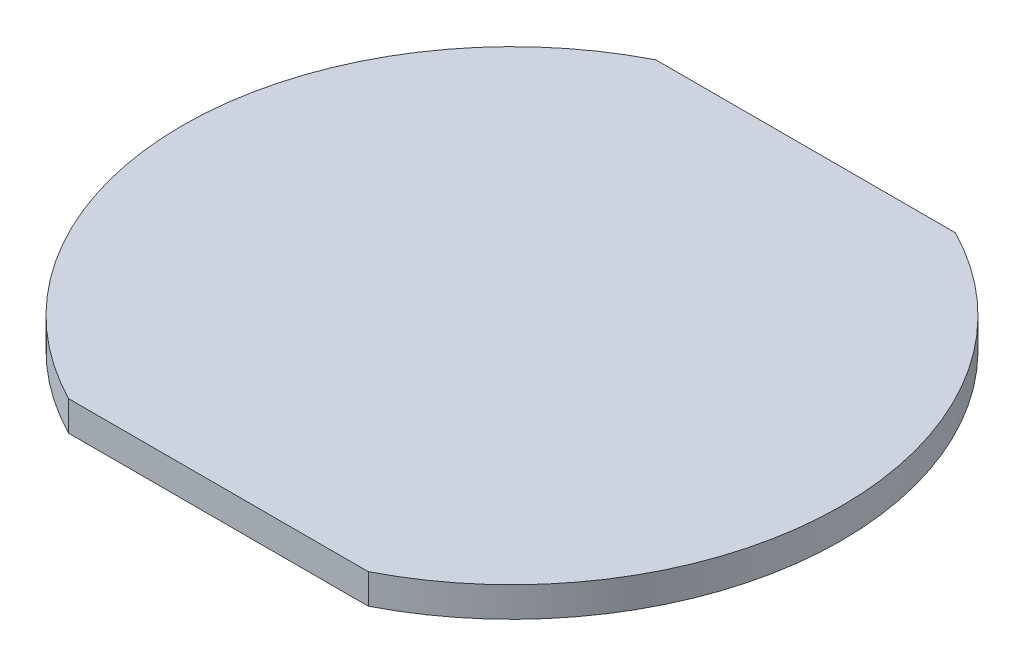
ISO-10303-21;
HEADER;
FILE_DESCRIPTION(('STEP AP214'),'2;1');
FILE_NAME('part.step','',(''),(''),'','','');
FILE_SCHEMA(('AUTOMOTIVE_DESIGN { 1 0 10303 214 1 1 1 1 }'));
ENDSEC;
DATA;
#1=APPLICATION_CONTEXT('core data for automotive mechanical design processes');
#2=APPLICATION_PROTOCOL_DEFINITION('international standard','automotive_design',2000,#1);
#3=PRODUCT_CONTEXT('',#1,'mechanical');
#4=PRODUCT('Part','Part','',(#3));
#5=PRODUCT_RELATED_PRODUCT_CATEGORY('part','',(#4));
#6=PRODUCT_DEFINITION_FORMATION('','',#4);
#7=PRODUCT_DEFINITION_CONTEXT('part definition',#1,'design');
#8=PRODUCT_DEFINITION('design','',#6,#7);
#9=PRODUCT_DEFINITION_SHAPE('','',#8);
#10=(LENGTH_UNIT() NAMED_UNIT(*) SI_UNIT(.MILLI.,.METRE.));
#11=(NAMED_UNIT(*) PLANE_ANGLE_UNIT() SI_UNIT($,.RADIAN.));
#12=(NAMED_UNIT(*) SI_UNIT($,.STERADIAN.) SOLID_ANGLE_UNIT());
#13=UNCERTAINTY_MEASURE_WITH_UNIT(LENGTH_MEASURE(1.E-05),#10,'distance_accuracy_value','');
#14=(GEOMETRIC_REPRESENTATION_CONTEXT(3) GLOBAL_UNCERTAINTY_ASSIGNED_CONTEXT((#13)) GLOBAL_UNIT_ASSIGNED_CONTEXT((#10,
#11,#12)) REPRESENTATION_CONTEXT('',''));
#15=CARTESIAN_POINT('',(0.,0.,0.));
#16=DIRECTION('',(0.,0.,1.));
#17=DIRECTION('',(1.,0.,0.));
#18=AXIS2_PLACEMENT_3D('',#15,#16,#17);
#19=CARTESIAN_POINT('',(0.,1.5,0.));
#20=DIRECTION('',(0.,1.,0.));
#21=DIRECTION('',(0.,0.,1.));
#22=AXIS2_PLACEMENT_3D('',#19,#20,#21);
#23=PLANE('',#22);
#24=DIRECTION('',(-1.,0.,0.));
#25=VECTOR('',#24,1.);
#26=CARTESIAN_POINT('',(7.5,1.5,-14.6969384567));
#27=LINE('',#26,#25);
#28=CARTESIAN_POINT('',(-7.49999999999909,1.5,-14.6969384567));
#29=VERTEX_POINT('',#28);
#30=CARTESIAN_POINT('',(7.49999999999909,1.5,-14.6969384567));
#31=VERTEX_POINT('',#30);
#32=EDGE_CURVE('E67',#29,#31,#27,.F.);
#33=ORIENTED_EDGE('',*,*,#32,.F.);
#34=CARTESIAN_POINT('',(0.,1.5,0.));
#35=DIRECTION('',(0.,1.,0.));
#36=DIRECTION('',(0.,0.,1.));
#37=AXIS2_PLACEMENT_3D('',#34,#35,#36);
#38=CIRCLE('',#37,16.5);
#39=CARTESIAN_POINT('',(-7.49999999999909,1.5,14.6969384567));
#40=VERTEX_POINT('',#39);
#41=EDGE_CURVE('E20',#40,#29,#38,.F.);
#42=ORIENTED_EDGE('',*,*,#41,.F.);
#43=DIRECTION('',(1.,0.,0.));
#44=VECTOR('',#43,1.);
#45=CARTESIAN_POINT('',(-7.5,1.5,14.6969384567));
#46=LINE('',#45,#44);
#47=CARTESIAN_POINT('',(7.4999999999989,1.5,14.6969384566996));
#48=VERTEX_POINT('',#47);
#49=EDGE_CURVE('E54',#48,#40,#46,.F.);
#50=ORIENTED_EDGE('',*,*,#49,.F.);
#51=CARTESIAN_POINT('',(0.,1.5,0.));
#52=DIRECTION('',(0.,1.,0.));
#53=DIRECTION('',(0.,0.,1.));
#54=AXIS2_PLACEMENT_3D('',#51,#52,#53);
#55=CIRCLE('',#54,16.5);
#56=EDGE_CURVE('E74',#31,#48,#55,.F.);
#57=ORIENTED_EDGE('',*,*,#56,.F.);
#58=EDGE_LOOP('',(#33,#42,#50,#57));
#59=FACE_BOUND('',#58,.T.);
#60=ADVANCED_FACE('F17',(#59),#23,.T.);
#61=CARTESIAN_POINT('',(0.,0.,0.));
#62=DIRECTION('',(0.,1.,0.));
#63=DIRECTION('',(0.,0.,1.));
#64=AXIS2_PLACEMENT_3D('',#61,#62,#63);
#65=CYLINDRICAL_SURFACE('',#64,16.5);
#66=DIRECTION('',(0.,1.,0.));
#67=VECTOR('',#66,1.);
#68=CARTESIAN_POINT('',(-7.5,0.,-14.6969384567));
#69=LINE('',#68,#67);
#70=CARTESIAN_POINT('',(-7.49999999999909,0.,-14.6969384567));
#71=VERTEX_POINT('',#70);
#72=EDGE_CURVE('E79',#71,#29,#69,.T.);
#73=ORIENTED_EDGE('',*,*,#72,.F.);
#74=CARTESIAN_POINT('',(0.,0.,0.));
#75=DIRECTION('',(0.,1.,0.));
#76=DIRECTION('',(0.,0.,1.));
#77=AXIS2_PLACEMENT_3D('',#74,#75,#76);
#78=CIRCLE('',#77,16.5);
#79=CARTESIAN_POINT('',(-7.49999999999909,0.,14.6969384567));
#80=VERTEX_POINT('',#79);
#81=EDGE_CURVE('E73',#71,#80,#78,.T.);
#82=ORIENTED_EDGE('',*,*,#81,.T.);
#83=DIRECTION('',(0.,1.,0.));
#84=VECTOR('',#83,1.);
#85=CARTESIAN_POINT('',(-7.5,0.,14.6969384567));
#86=LINE('',#85,#84);
#87=EDGE_CURVE('E59',#40,#80,#86,.F.);
#88=ORIENTED_EDGE('',*,*,#87,.F.);
#89=ORIENTED_EDGE('',*,*,#41,.T.);
#90=EDGE_LOOP('',(#73,#82,#88,#89));
#91=FACE_BOUND('',#90,.T.);
#92=ADVANCED_FACE('F72',(#91),#65,.T.);
#93=CARTESIAN_POINT('',(-7.5,0.,14.6969384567));
#94=DIRECTION('',(0.,0.,1.));
#95=DIRECTION('',(1.,0.,0.));
#96=AXIS2_PLACEMENT_3D('',#93,#94,#95);
#97=PLANE('',#96);
#98=ORIENTED_EDGE('',*,*,#87,.T.);
#99=DIRECTION('',(1.,0.,0.));
#100=VECTOR('',#99,1.);
#101=CARTESIAN_POINT('',(0.,0.,14.6969384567));
#102=LINE('',#101,#100);
#103=CARTESIAN_POINT('',(7.4999999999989,0.,14.6969384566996));
#104=VERTEX_POINT('',#103);
#105=EDGE_CURVE('E83',#80,#104,#102,.T.);
#106=ORIENTED_EDGE('',*,*,#105,.T.);
#107=DIRECTION('',(0.,1.,0.));
#108=VECTOR('',#107,1.);
#109=CARTESIAN_POINT('',(7.49999999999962,0.,14.6969384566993));
#110=LINE('',#109,#108);
#111=EDGE_CURVE('E61',#48,#104,#110,.F.);
#112=ORIENTED_EDGE('',*,*,#111,.F.);
#113=ORIENTED_EDGE('',*,*,#49,.T.);
#114=EDGE_LOOP('',(#98,#106,#112,#113));
#115=FACE_BOUND('',#114,.T.);
#116=ADVANCED_FACE('F56',(#115),#97,.T.);
#117=CARTESIAN_POINT('',(0.,0.,0.));
#118=DIRECTION('',(0.,1.,0.));
#119=DIRECTION('',(0.,0.,1.));
#120=AXIS2_PLACEMENT_3D('',#117,#118,#119);
#121=CYLINDRICAL_SURFACE('',#120,16.5);
#122=ORIENTED_EDGE('',*,*,#111,.T.);
#123=CARTESIAN_POINT('',(0.,0.,0.));
#124=DIRECTION('',(0.,1.,0.));
#125=DIRECTION('',(0.,0.,1.));
#126=AXIS2_PLACEMENT_3D('',#123,#124,#125);
#127=CIRCLE('',#126,16.5);
#128=CARTESIAN_POINT('',(7.49999999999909,0.,-14.6969384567));
#129=VERTEX_POINT('',#128);
#130=EDGE_CURVE('E26',#104,#129,#127,.T.);
#131=ORIENTED_EDGE('',*,*,#130,.T.);
#132=DIRECTION('',(0.,1.,0.));
#133=VECTOR('',#132,1.);
#134=CARTESIAN_POINT('',(7.5,0.,-14.6969384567));
#135=LINE('',#134,#133);
#136=EDGE_CURVE('E34',#31,#129,#135,.F.);
#137=ORIENTED_EDGE('',*,*,#136,.F.);
#138=ORIENTED_EDGE('',*,*,#56,.T.);
#139=EDGE_LOOP('',(#122,#131,#137,#138));
#140=FACE_BOUND('',#139,.T.);
#141=ADVANCED_FACE('F88',(#140),#121,.T.);
#142=CARTESIAN_POINT('',(7.5,0.,-14.6969384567));
#143=DIRECTION('',(0.,0.,-1.));
#144=DIRECTION('',(-1.,0.,0.));
#145=AXIS2_PLACEMENT_3D('',#142,#143,#144);
#146=PLANE('',#145);
#147=ORIENTED_EDGE('',*,*,#136,.T.);
#148=DIRECTION('',(1.,0.,0.));
#149=VECTOR('',#148,1.);
#150=CARTESIAN_POINT('',(0.,0.,-14.6969384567));
#151=LINE('',#150,#149);
#152=EDGE_CURVE('E11',#129,#71,#151,.F.);
#153=ORIENTED_EDGE('',*,*,#152,.T.);
#154=ORIENTED_EDGE('',*,*,#72,.T.);
#155=ORIENTED_EDGE('',*,*,#32,.T.);
#156=EDGE_LOOP('',(#147,#153,#154,#155));
#157=FACE_BOUND('',#156,.T.);
#158=ADVANCED_FACE('F91',(#157),#146,.T.);
#159=CARTESIAN_POINT('',(0.,0.,0.));
#160=DIRECTION('',(0.,1.,0.));
#161=DIRECTION('',(0.,0.,1.));
#162=AXIS2_PLACEMENT_3D('',#159,#160,#161);
#163=PLANE('',#162);
#164=ORIENTED_EDGE('',*,*,#130,.F.);
#165=ORIENTED_EDGE('',*,*,#105,.F.);
#166=ORIENTED_EDGE('',*,*,#81,.F.);
#167=ORIENTED_EDGE('',*,*,#152,.F.);
#168=EDGE_LOOP('',(#164,#165,#166,#167));
#169=FACE_BOUND('',#168,.T.);
#170=ADVANCED_FACE('F90',(#169),#163,.F.);
#171=CLOSED_SHELL('',(#60,#92,#116,#141,#158,#170));
#172=MANIFOLD_SOLID_BREP('B1',#171);
#173=ADVANCED_BREP_SHAPE_REPRESENTATION('',(#18,#172),#14);
#174=SHAPE_DEFINITION_REPRESENTATION(#9,#173);
ENDSEC;
END-ISO-10303-21;
